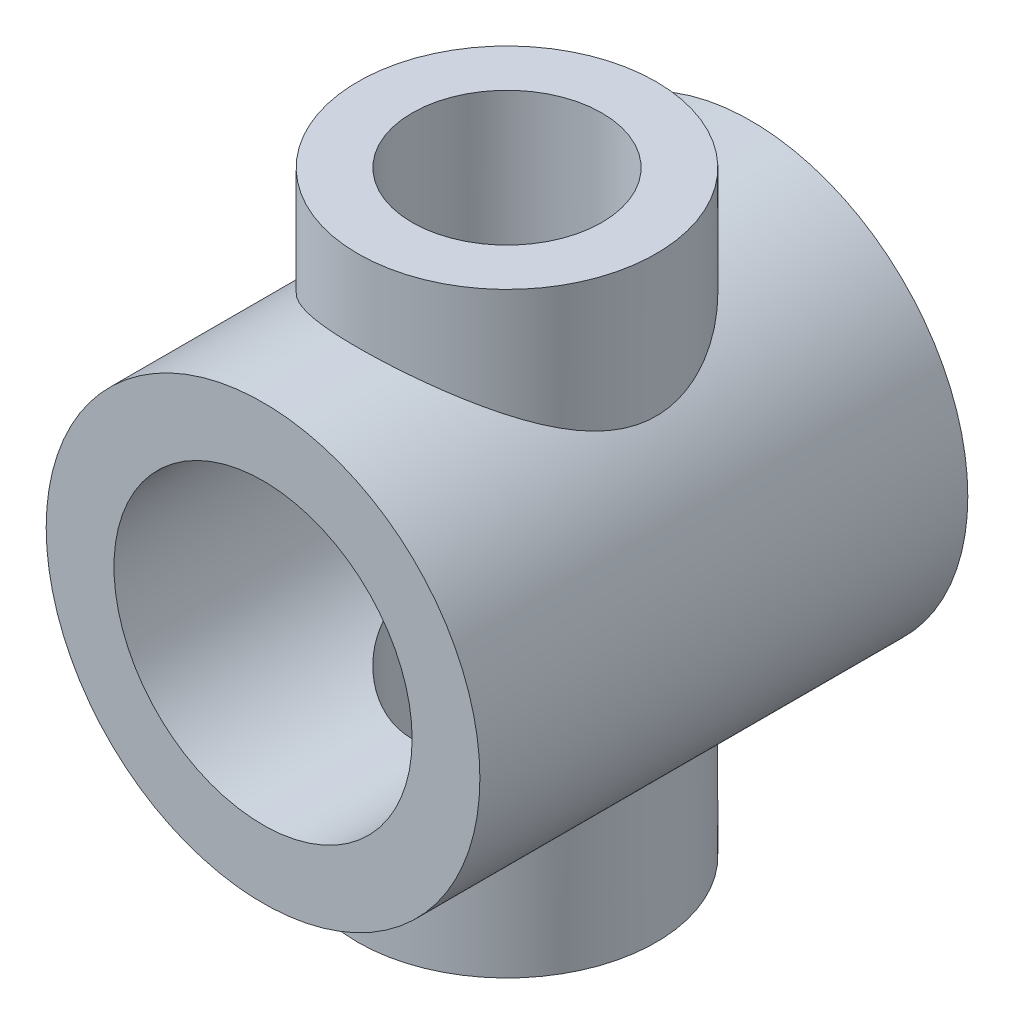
from build123d import *

# Parameters (mm, degrees)
SKETCH_1_R          = 8
EXTRUDE_1_DEPTH     = 18
SKETCH_3_R          = 5.5
EXTRUDE_3_DEPTH     = 11
SKETCH_4_R          = 3.5
CUT_EXTRUDE_4_DEPTH = 16
SKETCH_7_R          = 5.5
CUT_EXTRUDE_5_DEPTH = 21


with BuildPart() as part:
    # Sketch 1 → Extrude 1 (new body)
    with BuildSketch(Plane(origin=(0, 0, 0), x_dir=(0, -1, 0), z_dir=(0, 0, 1))):
        with Locations(Location((0, 0, 0), (0, 0, 90))):
            Circle(SKETCH_1_R)
    extrude(amount=EXTRUDE_1_DEPTH)

    # Sketch 3 → Extrude 3 (add, symmetric)
    with BuildSketch(Plane(origin=(0, 0, 0), x_dir=(1, 0, 0), z_dir=(0, 1, 0))):
        with Locations(Location((0, -9, 0), (0, 0, 90))):
            Circle(SKETCH_3_R)
    extrude(amount=EXTRUDE_3_DEPTH, both=True)

    # Sketch 4 → Cut-Extrude 4 (cut, symmetric)
    with BuildSketch(Plane(origin=(0, 0, 0), x_dir=(1, 0, 0), z_dir=(0, 1, 0))):
        with Locations(Location((0, -9, 0), (0, 0, 270))):
            Circle(SKETCH_4_R)
    extrude(amount=CUT_EXTRUDE_4_DEPTH, both=True, mode=Mode.SUBTRACT)

    # Sketch 7 → Cut-Extrude 5 (cut)
    with BuildSketch(Plane.XY):
        Circle(SKETCH_7_R)
    extrude(amount=CUT_EXTRUDE_5_DEPTH, mode=Mode.SUBTRACT)


solid = part.part
